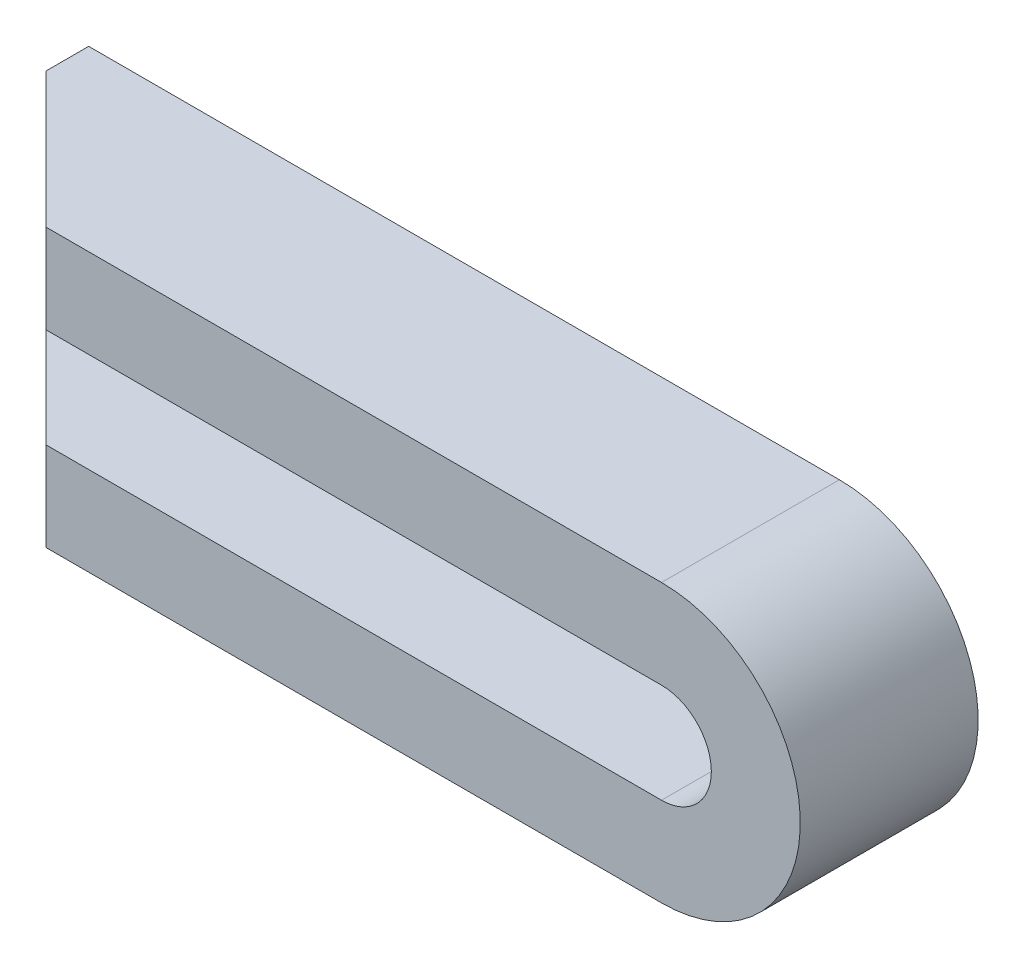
ISO-10303-21;
HEADER;
FILE_DESCRIPTION(('STEP AP214'),'2;1');
FILE_NAME('part.step','',(''),(''),'','','');
FILE_SCHEMA(('AUTOMOTIVE_DESIGN { 1 0 10303 214 1 1 1 1 }'));
ENDSEC;
DATA;
#1=APPLICATION_CONTEXT('core data for automotive mechanical design processes');
#2=APPLICATION_PROTOCOL_DEFINITION('international standard','automotive_design',2000,#1);
#3=PRODUCT_CONTEXT('',#1,'mechanical');
#4=PRODUCT('Part','Part','',(#3));
#5=PRODUCT_RELATED_PRODUCT_CATEGORY('part','',(#4));
#6=PRODUCT_DEFINITION_FORMATION('','',#4);
#7=PRODUCT_DEFINITION_CONTEXT('part definition',#1,'design');
#8=PRODUCT_DEFINITION('design','',#6,#7);
#9=PRODUCT_DEFINITION_SHAPE('','',#8);
#10=(LENGTH_UNIT() NAMED_UNIT(*) SI_UNIT(.MILLI.,.METRE.));
#11=(NAMED_UNIT(*) PLANE_ANGLE_UNIT() SI_UNIT($,.RADIAN.));
#12=(NAMED_UNIT(*) SI_UNIT($,.STERADIAN.) SOLID_ANGLE_UNIT());
#13=UNCERTAINTY_MEASURE_WITH_UNIT(LENGTH_MEASURE(1.E-05),#10,'distance_accuracy_value','');
#14=(GEOMETRIC_REPRESENTATION_CONTEXT(3) GLOBAL_UNCERTAINTY_ASSIGNED_CONTEXT((#13)) GLOBAL_UNIT_ASSIGNED_CONTEXT((#10,
#11,#12)) REPRESENTATION_CONTEXT('',''));
#15=CARTESIAN_POINT('',(0.,0.,0.));
#16=DIRECTION('',(0.,0.,1.));
#17=DIRECTION('',(1.,0.,0.));
#18=AXIS2_PLACEMENT_3D('',#15,#16,#17);
#19=CARTESIAN_POINT('',(-105.5,-7.,0.));
#20=DIRECTION('',(-1.,0.,0.));
#21=DIRECTION('',(0.,-1.,0.));
#22=AXIS2_PLACEMENT_3D('',#19,#20,#21);
#23=PLANE('',#22);
#24=DIRECTION('',(0.,1.,0.));
#25=VECTOR('',#24,1.);
#26=CARTESIAN_POINT('',(-105.5,0.,0.));
#27=LINE('',#26,#25);
#28=CARTESIAN_POINT('',(-105.5,-19.5,0.));
#29=VERTEX_POINT('',#28);
#30=CARTESIAN_POINT('',(-105.5,-7.,0.));
#31=VERTEX_POINT('',#30);
#32=EDGE_CURVE('E238',#29,#31,#27,.T.);
#33=ORIENTED_EDGE('',*,*,#32,.F.);
#34=DIRECTION('',(0.,0.,1.));
#35=VECTOR('',#34,1.);
#36=CARTESIAN_POINT('',(-105.5,-19.5,0.));
#37=LINE('',#36,#35);
#38=CARTESIAN_POINT('',(-105.4995,-19.5,5.999));
#39=VERTEX_POINT('',#38);
#40=EDGE_CURVE('E97',#39,#29,#37,.F.);
#41=ORIENTED_EDGE('',*,*,#40,.F.);
#42=DIRECTION('',(0.,-1.,0.));
#43=VECTOR('',#42,1.);
#44=CARTESIAN_POINT('',(-105.5,-7.,5.998));
#45=LINE('',#44,#43);
#46=CARTESIAN_POINT('',(-105.4995,-7.,5.999));
#47=VERTEX_POINT('',#46);
#48=EDGE_CURVE('E240',#47,#39,#45,.T.);
#49=ORIENTED_EDGE('',*,*,#48,.F.);
#50=DIRECTION('',(0.,0.,1.));
#51=VECTOR('',#50,1.);
#52=CARTESIAN_POINT('',(-105.5,-7.,0.));
#53=LINE('',#52,#51);
#54=EDGE_CURVE('E188',#31,#47,#53,.T.);
#55=ORIENTED_EDGE('',*,*,#54,.F.);
#56=EDGE_LOOP('',(#33,#41,#49,#55));
#57=FACE_BOUND('',#56,.T.);
#58=ADVANCED_FACE('F14',(#57),#23,.T.);
#59=CARTESIAN_POINT('',(20.2500020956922,19.5,0.));
#60=DIRECTION('',(0.,0.,-1.));
#61=DIRECTION('',(0.,-1.,0.));
#62=AXIS2_PLACEMENT_3D('',#59,#60,#61);
#63=PLANE('',#62);
#64=DIRECTION('',(0.,-1.,0.));
#65=VECTOR('',#64,1.);
#66=CARTESIAN_POINT('',(-105.5,13.25,0.));
#67=LINE('',#66,#65);
#68=CARTESIAN_POINT('',(-105.5,19.5,0.));
#69=VERTEX_POINT('',#68);
#70=CARTESIAN_POINT('',(-105.5,7.,0.));
#71=VERTEX_POINT('',#70);
#72=EDGE_CURVE('E220',#69,#71,#67,.T.);
#73=ORIENTED_EDGE('',*,*,#72,.F.);
#74=DIRECTION('',(-1.,0.,0.));
#75=VECTOR('',#74,1.);
#76=CARTESIAN_POINT('',(-52.75,19.5,0.));
#77=LINE('',#76,#75);
#78=CARTESIAN_POINT('',(0.,19.5,0.));
#79=VERTEX_POINT('',#78);
#80=EDGE_CURVE('E105',#79,#69,#77,.T.);
#81=ORIENTED_EDGE('',*,*,#80,.F.);
#82=CARTESIAN_POINT('',(0.,0.,0.));
#83=DIRECTION('',(0.,0.,1.));
#84=DIRECTION('',(0.,1.,0.));
#85=AXIS2_PLACEMENT_3D('',#82,#83,#84);
#86=CIRCLE('',#85,19.5);
#87=CARTESIAN_POINT('',(0.,-19.5,0.));
#88=VERTEX_POINT('',#87);
#89=EDGE_CURVE('E102',#88,#79,#86,.T.);
#90=ORIENTED_EDGE('',*,*,#89,.F.);
#91=DIRECTION('',(1.,0.,0.));
#92=VECTOR('',#91,1.);
#93=CARTESIAN_POINT('',(-52.75,-19.5,0.));
#94=LINE('',#93,#92);
#95=EDGE_CURVE('E88',#29,#88,#94,.T.);
#96=ORIENTED_EDGE('',*,*,#95,.F.);
#97=ORIENTED_EDGE('',*,*,#32,.T.);
#98=DIRECTION('',(-1.,0.,0.));
#99=VECTOR('',#98,1.);
#100=CARTESIAN_POINT('',(-52.75,-7.,0.));
#101=LINE('',#100,#99);
#102=CARTESIAN_POINT('',(0.,-7.,0.));
#103=VERTEX_POINT('',#102);
#104=EDGE_CURVE('E194',#103,#31,#101,.T.);
#105=ORIENTED_EDGE('',*,*,#104,.F.);
#106=CARTESIAN_POINT('',(0.,0.,0.));
#107=DIRECTION('',(0.,0.,1.));
#108=DIRECTION('',(0.,1.,0.));
#109=AXIS2_PLACEMENT_3D('',#106,#107,#108);
#110=CIRCLE('',#109,7.);
#111=CARTESIAN_POINT('',(0.,7.,0.));
#112=VERTEX_POINT('',#111);
#113=EDGE_CURVE('E108',#112,#103,#110,.F.);
#114=ORIENTED_EDGE('',*,*,#113,.F.);
#115=DIRECTION('',(1.,0.,0.));
#116=VECTOR('',#115,1.);
#117=CARTESIAN_POINT('',(-52.75,7.,0.));
#118=LINE('',#117,#116);
#119=EDGE_CURVE('E210',#71,#112,#118,.T.);
#120=ORIENTED_EDGE('',*,*,#119,.F.);
#121=EDGE_LOOP('',(#73,#81,#90,#96,#97,#105,#114,#120));
#122=FACE_BOUND('',#121,.T.);
#123=ADVANCED_FACE('F104',(#122),#63,.T.);
#124=CARTESIAN_POINT('',(-86.498,-7.,25.));
#125=DIRECTION('',(-0.707106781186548,0.,0.707106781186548));
#126=DIRECTION('',(-0.707106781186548,0.,-0.707106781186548));
#127=AXIS2_PLACEMENT_3D('',#124,#125,#126);
#128=PLANE('',#127);
#129=CARTESIAN_POINT('',(-86.498,-19.5,25.));
#130=CARTESIAN_POINT('',(-87.2897083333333,-19.5,24.2082916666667));
#131=CARTESIAN_POINT('',(-88.0814166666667,-19.5,23.4165833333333));
#132=CARTESIAN_POINT('',(-89.6648333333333,-19.5,21.8331666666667));
#133=CARTESIAN_POINT('',(-90.4565416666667,-19.5,21.0414583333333));
#134=CARTESIAN_POINT('',(-92.0399583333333,-19.5,19.4580416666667));
#135=CARTESIAN_POINT('',(-92.8316666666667,-19.5,18.6663333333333));
#136=CARTESIAN_POINT('',(-94.4150833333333,-19.5,17.0829166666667));
#137=CARTESIAN_POINT('',(-95.2067916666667,-19.5,16.2912083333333));
#138=CARTESIAN_POINT('',(-96.7902083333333,-19.5,14.7077916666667));
#139=CARTESIAN_POINT('',(-97.5819166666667,-19.5,13.9160833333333));
#140=CARTESIAN_POINT('',(-99.1653333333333,-19.5,12.3326666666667));
#141=CARTESIAN_POINT('',(-99.9570416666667,-19.5,11.5409583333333));
#142=CARTESIAN_POINT('',(-101.540458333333,-19.5,9.95754166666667));
#143=CARTESIAN_POINT('',(-102.332166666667,-19.5,9.16583333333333));
#144=CARTESIAN_POINT('',(-103.915583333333,-19.5,7.58241666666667));
#145=CARTESIAN_POINT('',(-104.707291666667,-19.5,6.79070833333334));
#146=CARTESIAN_POINT('',(-105.499,-19.5,5.999));
#147=B_SPLINE_CURVE_WITH_KNOTS('',3,(#129,#130,#131,#132,#133,#134,#135,#136,#137,#138,#139,
#140,#141,#142,#143,#144,#145,#146),.UNSPECIFIED.,.F.,.F.,(4,2,2,2,2,2,2,2,4),(0.,
3.35893398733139,6.71786797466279,10.0768019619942,13.4357359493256,16.794669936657,
20.1536039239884,23.5125379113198,26.8714718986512),.UNSPECIFIED.);
#148=CARTESIAN_POINT('',(-86.498,-19.5,25.));
#149=VERTEX_POINT('',#148);
#150=EDGE_CURVE('E252',#149,#39,#147,.T.);
#151=ORIENTED_EDGE('',*,*,#150,.F.);
#152=DIRECTION('',(0.,-1.,0.));
#153=VECTOR('',#152,1.);
#154=CARTESIAN_POINT('',(-86.498,0.,25.));
#155=LINE('',#154,#153);
#156=CARTESIAN_POINT('',(-86.498,-7.,25.));
#157=VERTEX_POINT('',#156);
#158=EDGE_CURVE('E121',#157,#149,#155,.T.);
#159=ORIENTED_EDGE('',*,*,#158,.F.);
#160=CARTESIAN_POINT('',(-105.499,-7.,5.999));
#161=CARTESIAN_POINT('',(-104.707291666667,-7.,6.79070833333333));
#162=CARTESIAN_POINT('',(-103.915583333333,-7.,7.58241666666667));
#163=CARTESIAN_POINT('',(-102.332166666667,-7.,9.16583333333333));
#164=CARTESIAN_POINT('',(-101.540458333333,-7.,9.95754166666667));
#165=CARTESIAN_POINT('',(-99.9570416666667,-7.,11.5409583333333));
#166=CARTESIAN_POINT('',(-99.1653333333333,-7.,12.3326666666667));
#167=CARTESIAN_POINT('',(-97.5819166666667,-7.,13.9160833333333));
#168=CARTESIAN_POINT('',(-96.7902083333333,-7.,14.7077916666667));
#169=CARTESIAN_POINT('',(-95.2067916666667,-7.,16.2912083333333));
#170=CARTESIAN_POINT('',(-94.4150833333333,-7.,17.0829166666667));
#171=CARTESIAN_POINT('',(-92.8316666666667,-7.,18.6663333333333));
#172=CARTESIAN_POINT('',(-92.0399583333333,-7.,19.4580416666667));
#173=CARTESIAN_POINT('',(-90.4565416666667,-7.,21.0414583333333));
#174=CARTESIAN_POINT('',(-89.6648333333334,-7.,21.8331666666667));
#175=CARTESIAN_POINT('',(-88.0814166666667,-7.,23.4165833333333));
#176=CARTESIAN_POINT('',(-87.2897083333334,-7.,24.2082916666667));
#177=CARTESIAN_POINT('',(-86.498,-7.,25.));
#178=B_SPLINE_CURVE_WITH_KNOTS('',3,(#160,#161,#162,#163,#164,#165,#166,#167,#168,#169,#170,
#171,#172,#173,#174,#175,#176,#177),.UNSPECIFIED.,.F.,.F.,(4,2,2,2,2,2,2,2,4),(0.,
3.35893398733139,6.71786797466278,10.0768019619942,13.4357359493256,16.794669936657,
20.1536039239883,23.5125379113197,26.8714718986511),.UNSPECIFIED.);
#179=EDGE_CURVE('E197',#47,#157,#178,.T.);
#180=ORIENTED_EDGE('',*,*,#179,.F.);
#181=ORIENTED_EDGE('',*,*,#48,.T.);
#182=EDGE_LOOP('',(#151,#159,#180,#181));
#183=FACE_BOUND('',#182,.T.);
#184=ADVANCED_FACE('F144',(#183),#128,.T.);
#185=CARTESIAN_POINT('',(-105.5,-19.5,0.));
#186=DIRECTION('',(0.,-1.,0.));
#187=DIRECTION('',(1.,0.,0.));
#188=AXIS2_PLACEMENT_3D('',#185,#186,#187);
#189=PLANE('',#188);
#190=DIRECTION('',(0.,0.,-1.));
#191=VECTOR('',#190,1.);
#192=CARTESIAN_POINT('',(0.,-19.5,12.5));
#193=LINE('',#192,#191);
#194=CARTESIAN_POINT('',(0.,-19.5,25.));
#195=VERTEX_POINT('',#194);
#196=EDGE_CURVE('E93',#195,#88,#193,.T.);
#197=ORIENTED_EDGE('',*,*,#196,.F.);
#198=DIRECTION('',(-1.,0.,0.));
#199=VECTOR('',#198,1.);
#200=CARTESIAN_POINT('',(19.5,-19.5,25.));
#201=LINE('',#200,#199);
#202=EDGE_CURVE('E119',#149,#195,#201,.F.);
#203=ORIENTED_EDGE('',*,*,#202,.F.);
#204=ORIENTED_EDGE('',*,*,#150,.T.);
#205=ORIENTED_EDGE('',*,*,#40,.T.);
#206=ORIENTED_EDGE('',*,*,#95,.T.);
#207=EDGE_LOOP('',(#197,#203,#204,#205,#206));
#208=FACE_BOUND('',#207,.T.);
#209=ADVANCED_FACE('F90',(#208),#189,.T.);
#210=CARTESIAN_POINT('',(0.,0.,25.));
#211=DIRECTION('',(0.,0.,1.));
#212=DIRECTION('',(0.,1.,0.));
#213=AXIS2_PLACEMENT_3D('',#210,#211,#212);
#214=CYLINDRICAL_SURFACE('',#213,19.5);
#215=ORIENTED_EDGE('',*,*,#89,.T.);
#216=DIRECTION('',(0.,0.,1.));
#217=VECTOR('',#216,1.);
#218=CARTESIAN_POINT('',(0.,19.5,0.));
#219=LINE('',#218,#217);
#220=CARTESIAN_POINT('',(0.,19.5,25.));
#221=VERTEX_POINT('',#220);
#222=EDGE_CURVE('E117',#221,#79,#219,.F.);
#223=ORIENTED_EDGE('',*,*,#222,.F.);
#224=CARTESIAN_POINT('',(0.,0.,25.));
#225=DIRECTION('',(0.,0.,1.));
#226=DIRECTION('',(0.,1.,0.));
#227=AXIS2_PLACEMENT_3D('',#224,#225,#226);
#228=CIRCLE('',#227,19.5);
#229=EDGE_CURVE('E112',#195,#221,#228,.T.);
#230=ORIENTED_EDGE('',*,*,#229,.F.);
#231=ORIENTED_EDGE('',*,*,#196,.T.);
#232=EDGE_LOOP('',(#215,#223,#230,#231));
#233=FACE_BOUND('',#232,.T.);
#234=ADVANCED_FACE('F110',(#233),#214,.T.);
#235=CARTESIAN_POINT('',(0.,0.,0.));
#236=DIRECTION('',(0.,0.,1.));
#237=DIRECTION('',(0.,1.,0.));
#238=AXIS2_PLACEMENT_3D('',#235,#236,#237);
#239=CYLINDRICAL_SURFACE('',#238,7.);
#240=ORIENTED_EDGE('',*,*,#113,.T.);
#241=DIRECTION('',(0.,0.,1.));
#242=VECTOR('',#241,1.);
#243=CARTESIAN_POINT('',(0.,-7.,0.));
#244=LINE('',#243,#242);
#245=CARTESIAN_POINT('',(0.,-7.,25.));
#246=VERTEX_POINT('',#245);
#247=EDGE_CURVE('E200',#246,#103,#244,.F.);
#248=ORIENTED_EDGE('',*,*,#247,.F.);
#249=CARTESIAN_POINT('',(0.,0.,25.));
#250=DIRECTION('',(0.,0.,1.));
#251=DIRECTION('',(0.,1.,0.));
#252=AXIS2_PLACEMENT_3D('',#249,#250,#251);
#253=CIRCLE('',#252,7.);
#254=CARTESIAN_POINT('',(0.,7.,25.));
#255=VERTEX_POINT('',#254);
#256=EDGE_CURVE('E205',#255,#246,#253,.F.);
#257=ORIENTED_EDGE('',*,*,#256,.F.);
#258=DIRECTION('',(0.,0.,1.));
#259=VECTOR('',#258,1.);
#260=CARTESIAN_POINT('',(0.,7.,0.));
#261=LINE('',#260,#259);
#262=EDGE_CURVE('E209',#112,#255,#261,.T.);
#263=ORIENTED_EDGE('',*,*,#262,.F.);
#264=EDGE_LOOP('',(#240,#248,#257,#263));
#265=FACE_BOUND('',#264,.T.);
#266=ADVANCED_FACE('F260',(#265),#239,.F.);
#267=CARTESIAN_POINT('',(0.,-7.,0.));
#268=DIRECTION('',(0.,1.,0.));
#269=DIRECTION('',(-1.,0.,0.));
#270=AXIS2_PLACEMENT_3D('',#267,#268,#269);
#271=PLANE('',#270);
#272=ORIENTED_EDGE('',*,*,#104,.T.);
#273=ORIENTED_EDGE('',*,*,#54,.T.);
#274=ORIENTED_EDGE('',*,*,#179,.T.);
#275=DIRECTION('',(-1.,0.,0.));
#276=VECTOR('',#275,1.);
#277=CARTESIAN_POINT('',(19.5,-7.,25.));
#278=LINE('',#277,#276);
#279=EDGE_CURVE('E201',#246,#157,#278,.T.);
#280=ORIENTED_EDGE('',*,*,#279,.F.);
#281=ORIENTED_EDGE('',*,*,#247,.T.);
#282=EDGE_LOOP('',(#272,#273,#274,#280,#281));
#283=FACE_BOUND('',#282,.T.);
#284=ADVANCED_FACE('F175',(#283),#271,.T.);
#285=CARTESIAN_POINT('',(0.,19.5,0.));
#286=DIRECTION('',(0.,1.,0.));
#287=DIRECTION('',(-1.,0.,0.));
#288=AXIS2_PLACEMENT_3D('',#285,#286,#287);
#289=PLANE('',#288);
#290=ORIENTED_EDGE('',*,*,#80,.T.);
#291=DIRECTION('',(0.,0.,1.));
#292=VECTOR('',#291,1.);
#293=CARTESIAN_POINT('',(-105.5,19.5,0.));
#294=LINE('',#293,#292);
#295=CARTESIAN_POINT('',(-105.5,19.5,5.998));
#296=VERTEX_POINT('',#295);
#297=EDGE_CURVE('E228',#296,#69,#294,.F.);
#298=ORIENTED_EDGE('',*,*,#297,.F.);
#299=DIRECTION('',(-0.707106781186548,0.,-0.707106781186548));
#300=VECTOR('',#299,1.);
#301=CARTESIAN_POINT('',(-95.9985,19.5,15.4995));
#302=LINE('',#301,#300);
#303=CARTESIAN_POINT('',(-86.498,19.5,25.));
#304=VERTEX_POINT('',#303);
#305=EDGE_CURVE('E204',#304,#296,#302,.T.);
#306=ORIENTED_EDGE('',*,*,#305,.F.);
#307=DIRECTION('',(-1.,0.,0.));
#308=VECTOR('',#307,1.);
#309=CARTESIAN_POINT('',(19.5,19.5,25.));
#310=LINE('',#309,#308);
#311=EDGE_CURVE('E251',#221,#304,#310,.T.);
#312=ORIENTED_EDGE('',*,*,#311,.F.);
#313=ORIENTED_EDGE('',*,*,#222,.T.);
#314=EDGE_LOOP('',(#290,#298,#306,#312,#313));
#315=FACE_BOUND('',#314,.T.);
#316=ADVANCED_FACE('F171',(#315),#289,.T.);
#317=CARTESIAN_POINT('',(-105.5,19.5,0.));
#318=DIRECTION('',(-1.,0.,0.));
#319=DIRECTION('',(0.,-1.,0.));
#320=AXIS2_PLACEMENT_3D('',#317,#318,#319);
#321=PLANE('',#320);
#322=ORIENTED_EDGE('',*,*,#72,.T.);
#323=DIRECTION('',(0.,0.,1.));
#324=VECTOR('',#323,1.);
#325=CARTESIAN_POINT('',(-105.5,7.,0.));
#326=LINE('',#325,#324);
#327=CARTESIAN_POINT('',(-105.5,7.,5.998));
#328=VERTEX_POINT('',#327);
#329=EDGE_CURVE('E216',#328,#71,#326,.F.);
#330=ORIENTED_EDGE('',*,*,#329,.F.);
#331=DIRECTION('',(0.,-1.,0.));
#332=VECTOR('',#331,1.);
#333=CARTESIAN_POINT('',(-105.5,19.5,5.998));
#334=LINE('',#333,#332);
#335=EDGE_CURVE('E245',#296,#328,#334,.T.);
#336=ORIENTED_EDGE('',*,*,#335,.F.);
#337=ORIENTED_EDGE('',*,*,#297,.T.);
#338=EDGE_LOOP('',(#322,#330,#336,#337));
#339=FACE_BOUND('',#338,.T.);
#340=ADVANCED_FACE('F168',(#339),#321,.T.);
#341=CARTESIAN_POINT('',(-105.5,7.,0.));
#342=DIRECTION('',(0.,-1.,0.));
#343=DIRECTION('',(1.,0.,0.));
#344=AXIS2_PLACEMENT_3D('',#341,#342,#343);
#345=PLANE('',#344);
#346=ORIENTED_EDGE('',*,*,#262,.T.);
#347=DIRECTION('',(-1.,0.,0.));
#348=VECTOR('',#347,1.);
#349=CARTESIAN_POINT('',(19.5,7.,25.));
#350=LINE('',#349,#348);
#351=CARTESIAN_POINT('',(-86.498,7.,25.));
#352=VERTEX_POINT('',#351);
#353=EDGE_CURVE('E32',#352,#255,#350,.F.);
#354=ORIENTED_EDGE('',*,*,#353,.F.);
#355=DIRECTION('',(0.707106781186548,0.,0.707106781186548));
#356=VECTOR('',#355,1.);
#357=CARTESIAN_POINT('',(-95.9985,7.,15.4995));
#358=LINE('',#357,#356);
#359=EDGE_CURVE('E23',#328,#352,#358,.T.);
#360=ORIENTED_EDGE('',*,*,#359,.F.);
#361=ORIENTED_EDGE('',*,*,#329,.T.);
#362=ORIENTED_EDGE('',*,*,#119,.T.);
#363=EDGE_LOOP('',(#346,#354,#360,#361,#362));
#364=FACE_BOUND('',#363,.T.);
#365=ADVANCED_FACE('F161',(#364),#345,.T.);
#366=CARTESIAN_POINT('',(20.1359900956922,-19.5,25.));
#367=DIRECTION('',(0.,0.,1.));
#368=DIRECTION('',(0.,1.,0.));
#369=AXIS2_PLACEMENT_3D('',#366,#367,#368);
#370=PLANE('',#369);
#371=ORIENTED_EDGE('',*,*,#256,.T.);
#372=ORIENTED_EDGE('',*,*,#279,.T.);
#373=ORIENTED_EDGE('',*,*,#158,.T.);
#374=ORIENTED_EDGE('',*,*,#202,.T.);
#375=ORIENTED_EDGE('',*,*,#229,.T.);
#376=ORIENTED_EDGE('',*,*,#311,.T.);
#377=DIRECTION('',(0.,-1.,0.));
#378=VECTOR('',#377,1.);
#379=CARTESIAN_POINT('',(-86.498,19.5,25.));
#380=LINE('',#379,#378);
#381=EDGE_CURVE('E9',#352,#304,#380,.F.);
#382=ORIENTED_EDGE('',*,*,#381,.F.);
#383=ORIENTED_EDGE('',*,*,#353,.T.);
#384=EDGE_LOOP('',(#371,#372,#373,#374,#375,#376,#382,#383));
#385=FACE_BOUND('',#384,.T.);
#386=ADVANCED_FACE('F155',(#385),#370,.T.);
#387=CARTESIAN_POINT('',(-86.498,19.5,25.));
#388=DIRECTION('',(-0.707106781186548,0.,0.707106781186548));
#389=DIRECTION('',(-0.707106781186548,0.,-0.707106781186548));
#390=AXIS2_PLACEMENT_3D('',#387,#388,#389);
#391=PLANE('',#390);
#392=ORIENTED_EDGE('',*,*,#359,.T.);
#393=ORIENTED_EDGE('',*,*,#381,.T.);
#394=ORIENTED_EDGE('',*,*,#305,.T.);
#395=ORIENTED_EDGE('',*,*,#335,.T.);
#396=EDGE_LOOP('',(#392,#393,#394,#395));
#397=FACE_BOUND('',#396,.T.);
#398=ADVANCED_FACE('F153',(#397),#391,.T.);
#399=CLOSED_SHELL('',(#58,#123,#184,#209,#234,#266,#284,#316,#340,#365,#386,#398));
#400=MANIFOLD_SOLID_BREP('B1',#399);
#401=ADVANCED_BREP_SHAPE_REPRESENTATION('',(#18,#400),#14);
#402=SHAPE_DEFINITION_REPRESENTATION(#9,#401);
ENDSEC;
END-ISO-10303-21;
